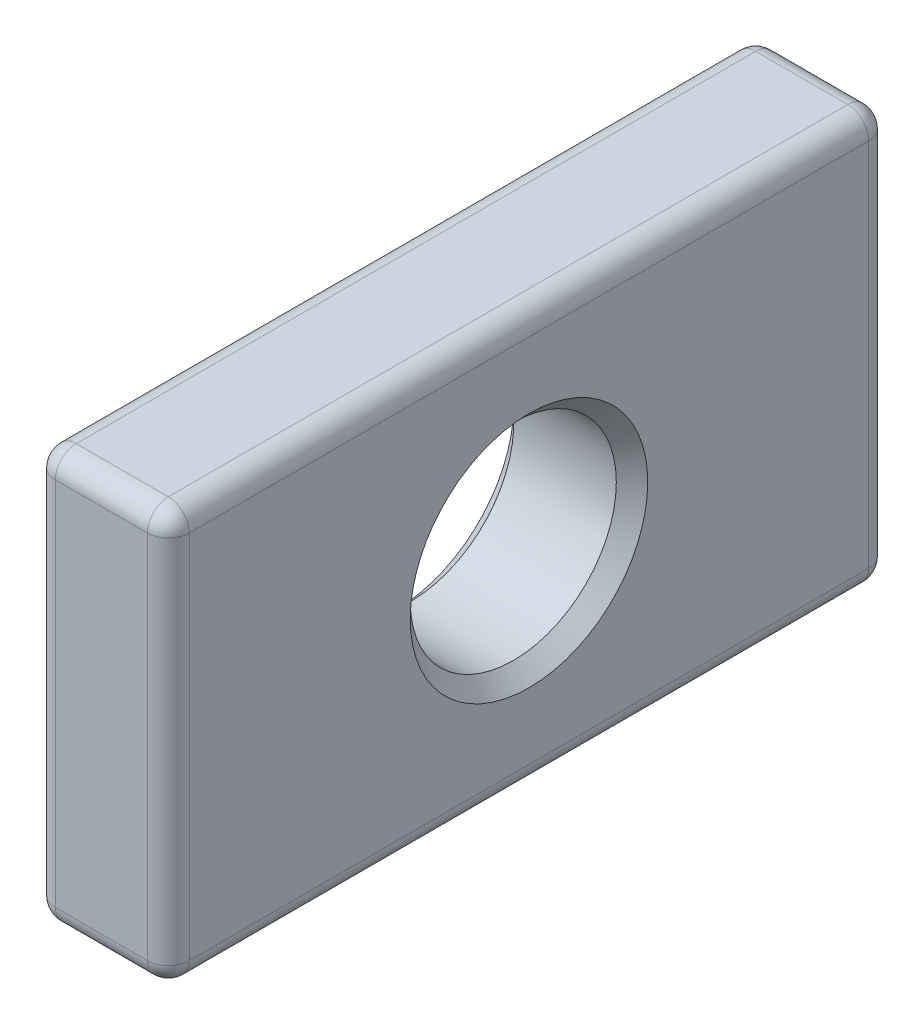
from build123d import *

# Parameters (mm, degrees)
SKETCH1_W           = 35
SKETCH1_H           = 20
SKETCH1_R           = 5
BOSS_EXTRUDE1_DEPTH = 3.25
FILLET1_R           = 1.016
CHAMFER1_SIZE       = 0.762


with BuildPart() as part:
    # Sketch1 → Boss-Extrude1 (new, symmetric)
    with BuildSketch(Plane(origin=(0, 0, 0), x_dir=(0, 0, -1), z_dir=(1, 0, 0))):
        Rectangle(SKETCH1_W, SKETCH1_H)
        with Locations(Location((0, 0, 0), (0, 0, 180))):
            Circle(SKETCH1_R, mode=Mode.SUBTRACT)
    extrude(amount=BOSS_EXTRUDE1_DEPTH, both=True)

    # Fillet1
    fillet1_edges = [part.edges().sort_by_distance(p)[0] for p in [
        (3.25, 0, 17.5),
        (3.25, -10, 0),
        (3.25, 0, -17.5),
        (-3.25, -10, 0),
        (-3.25, 0, 17.5),
        (-3.25, 10, 0),
        (-3.25, 0, -17.5),
        (3.25, 10, 0),
        (0, -10, -17.5),
        (0, -10, 17.5),
        (0, 10, 17.5),
        (0, 10, -17.5),
    ]]
    fillet(fillet1_edges, radius=FILLET1_R)

    # Chamfer1
    chamfer1_edges = [part.edges().sort_by_distance(p)[0] for p in [
        (-3.25, 0, -5),
        (3.25, 0, -5),
    ]]
    chamfer(chamfer1_edges, length=CHAMFER1_SIZE)


solid = part.part
